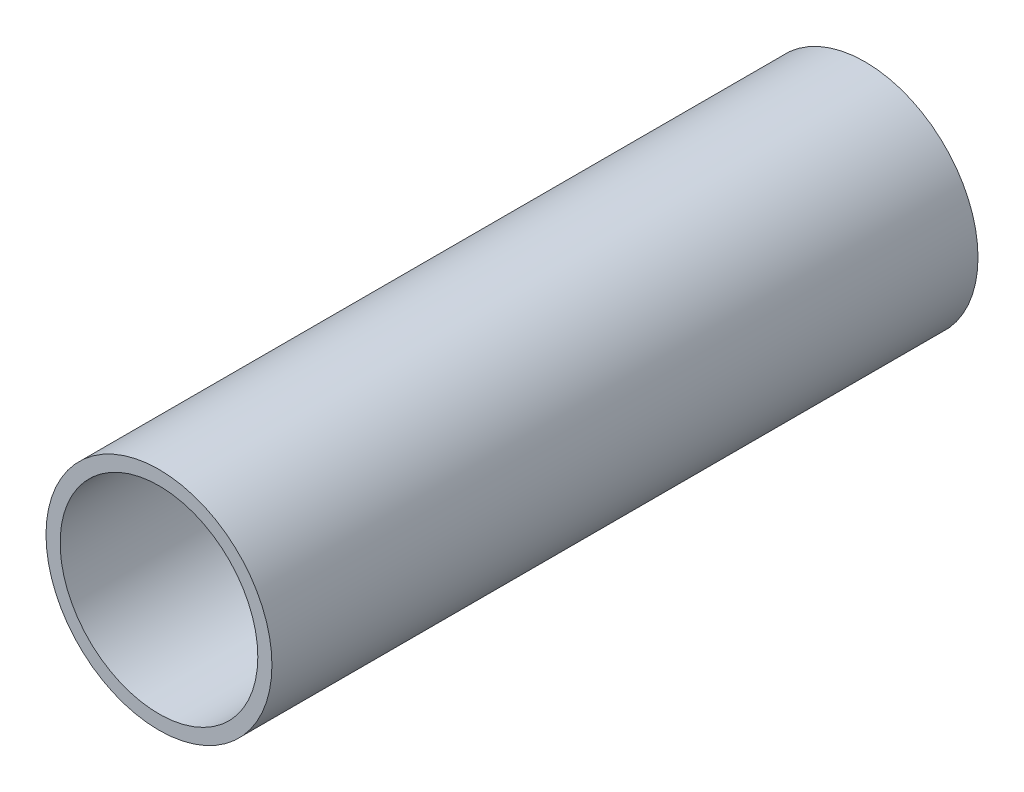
ISO-10303-21;
HEADER;
FILE_DESCRIPTION(('STEP AP214'),'2;1');
FILE_NAME('part.step','',(''),(''),'','','');
FILE_SCHEMA(('AUTOMOTIVE_DESIGN { 1 0 10303 214 1 1 1 1 }'));
ENDSEC;
DATA;
#1=APPLICATION_CONTEXT('core data for automotive mechanical design processes');
#2=APPLICATION_PROTOCOL_DEFINITION('international standard','automotive_design',2000,#1);
#3=PRODUCT_CONTEXT('',#1,'mechanical');
#4=PRODUCT('Part','Part','',(#3));
#5=PRODUCT_RELATED_PRODUCT_CATEGORY('part','',(#4));
#6=PRODUCT_DEFINITION_FORMATION('','',#4);
#7=PRODUCT_DEFINITION_CONTEXT('part definition',#1,'design');
#8=PRODUCT_DEFINITION('design','',#6,#7);
#9=PRODUCT_DEFINITION_SHAPE('','',#8);
#10=(LENGTH_UNIT() NAMED_UNIT(*) SI_UNIT(.MILLI.,.METRE.));
#11=(NAMED_UNIT(*) PLANE_ANGLE_UNIT() SI_UNIT($,.RADIAN.));
#12=(NAMED_UNIT(*) SI_UNIT($,.STERADIAN.) SOLID_ANGLE_UNIT());
#13=UNCERTAINTY_MEASURE_WITH_UNIT(LENGTH_MEASURE(1.E-05),#10,'distance_accuracy_value','');
#14=(GEOMETRIC_REPRESENTATION_CONTEXT(3) GLOBAL_UNCERTAINTY_ASSIGNED_CONTEXT((#13)) GLOBAL_UNIT_ASSIGNED_CONTEXT((#10,
#11,#12)) REPRESENTATION_CONTEXT('',''));
#15=CARTESIAN_POINT('',(0.,0.,0.));
#16=DIRECTION('',(0.,0.,1.));
#17=DIRECTION('',(1.,0.,0.));
#18=AXIS2_PLACEMENT_3D('',#15,#16,#17);
#19=CARTESIAN_POINT('',(0.,0.,100.));
#20=DIRECTION('',(0.,0.,1.));
#21=DIRECTION('',(1.,0.,0.));
#22=AXIS2_PLACEMENT_3D('',#19,#20,#21);
#23=PLANE('',#22);
#24=CARTESIAN_POINT('',(0.,0.,100.));
#25=DIRECTION('',(0.,0.,1.));
#26=DIRECTION('',(1.,0.,0.));
#27=AXIS2_PLACEMENT_3D('',#24,#25,#26);
#28=CIRCLE('',#27,16.);
#29=CARTESIAN_POINT('',(16.,0.,100.));
#30=VERTEX_POINT('',#29);
#31=EDGE_CURVE('E10',#30,#30,#28,.T.);
#32=ORIENTED_EDGE('',*,*,#31,.T.);
#33=EDGE_LOOP('',(#32));
#34=FACE_BOUND('',#33,.T.);
#35=CARTESIAN_POINT('',(0.,0.,100.));
#36=DIRECTION('',(0.,0.,1.));
#37=DIRECTION('',(1.,0.,0.));
#38=AXIS2_PLACEMENT_3D('',#35,#36,#37);
#39=CIRCLE('',#38,14.);
#40=CARTESIAN_POINT('',(14.,0.,100.));
#41=VERTEX_POINT('',#40);
#42=EDGE_CURVE('E48',#41,#41,#39,.T.);
#43=ORIENTED_EDGE('',*,*,#42,.F.);
#44=EDGE_LOOP('',(#43));
#45=FACE_BOUND('',#44,.T.);
#46=ADVANCED_FACE('F37',(#34,#45),#23,.T.);
#47=CARTESIAN_POINT('',(0.,0.,0.));
#48=DIRECTION('',(0.,0.,1.));
#49=DIRECTION('',(1.,0.,0.));
#50=AXIS2_PLACEMENT_3D('',#47,#48,#49);
#51=PLANE('',#50);
#52=CARTESIAN_POINT('',(0.,0.,0.));
#53=DIRECTION('',(0.,0.,1.));
#54=DIRECTION('',(1.,0.,0.));
#55=AXIS2_PLACEMENT_3D('',#52,#53,#54);
#56=CIRCLE('',#55,16.);
#57=CARTESIAN_POINT('',(16.,0.,0.));
#58=VERTEX_POINT('',#57);
#59=EDGE_CURVE('E41',#58,#58,#56,.T.);
#60=ORIENTED_EDGE('',*,*,#59,.F.);
#61=EDGE_LOOP('',(#60));
#62=FACE_BOUND('',#61,.T.);
#63=CARTESIAN_POINT('',(0.,0.,0.));
#64=DIRECTION('',(0.,0.,1.));
#65=DIRECTION('',(1.,0.,0.));
#66=AXIS2_PLACEMENT_3D('',#63,#64,#65);
#67=CIRCLE('',#66,14.);
#68=CARTESIAN_POINT('',(14.,0.,0.));
#69=VERTEX_POINT('',#68);
#70=EDGE_CURVE('E50',#69,#69,#67,.T.);
#71=ORIENTED_EDGE('',*,*,#70,.T.);
#72=EDGE_LOOP('',(#71));
#73=FACE_BOUND('',#72,.T.);
#74=ADVANCED_FACE('F60',(#62,#73),#51,.F.);
#75=CARTESIAN_POINT('',(0.,0.,100.));
#76=DIRECTION('',(0.,0.,-1.));
#77=DIRECTION('',(-1.,0.,0.));
#78=AXIS2_PLACEMENT_3D('',#75,#76,#77);
#79=CYLINDRICAL_SURFACE('',#78,16.);
#80=ORIENTED_EDGE('',*,*,#31,.F.);
#81=EDGE_LOOP('',(#80));
#82=FACE_BOUND('',#81,.T.);
#83=ORIENTED_EDGE('',*,*,#59,.T.);
#84=EDGE_LOOP('',(#83));
#85=FACE_BOUND('',#84,.T.);
#86=ADVANCED_FACE('F39',(#82,#85),#79,.T.);
#87=CARTESIAN_POINT('',(0.,0.,100.));
#88=DIRECTION('',(0.,0.,-1.));
#89=DIRECTION('',(-1.,0.,0.));
#90=AXIS2_PLACEMENT_3D('',#87,#88,#89);
#91=CYLINDRICAL_SURFACE('',#90,14.);
#92=ORIENTED_EDGE('',*,*,#42,.T.);
#93=EDGE_LOOP('',(#92));
#94=FACE_BOUND('',#93,.T.);
#95=ORIENTED_EDGE('',*,*,#70,.F.);
#96=EDGE_LOOP('',(#95));
#97=FACE_BOUND('',#96,.T.);
#98=ADVANCED_FACE('F56',(#94,#97),#91,.F.);
#99=CLOSED_SHELL('',(#46,#74,#86,#98));
#100=MANIFOLD_SOLID_BREP('B2',#99);
#101=ADVANCED_BREP_SHAPE_REPRESENTATION('',(#18,#100),#14);
#102=SHAPE_DEFINITION_REPRESENTATION(#9,#101);
ENDSEC;
END-ISO-10303-21;
